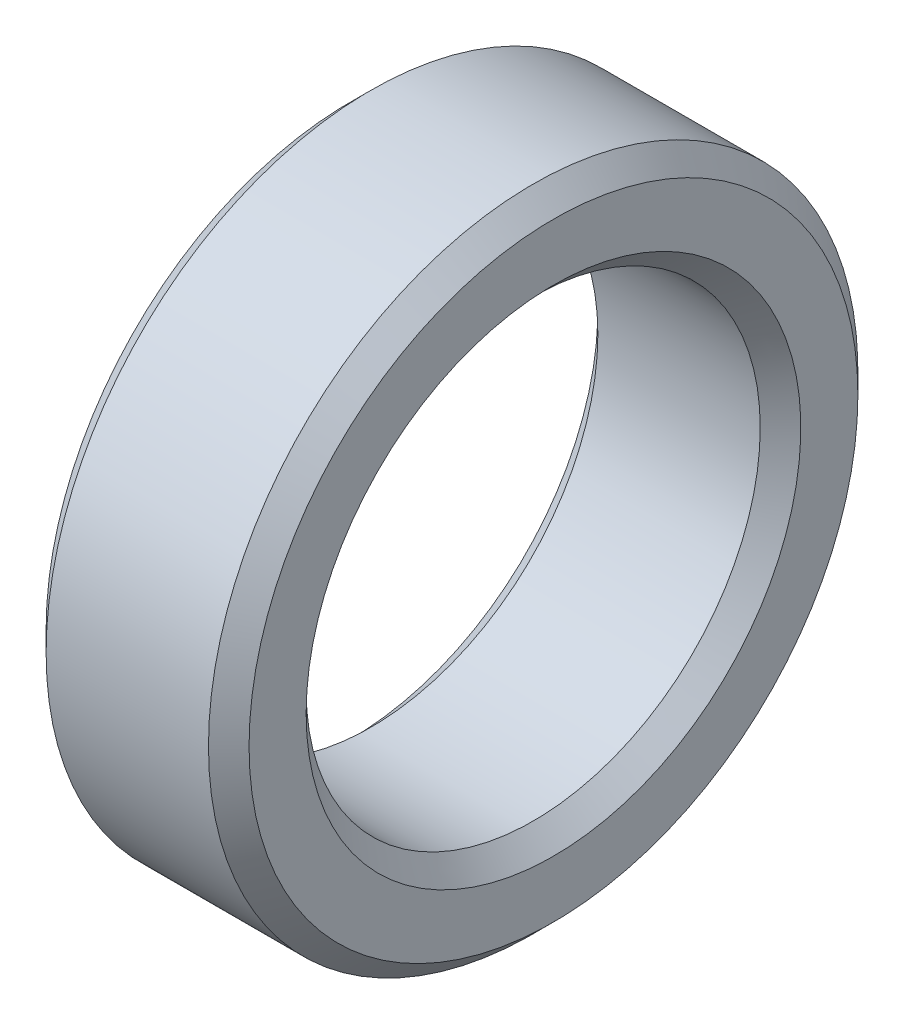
from build123d import *


with BuildPart() as part:
    # Sketch 1 → Revolve 1 (revolve)
    with BuildSketch(Plane.XY, mode=Mode.PRIVATE) as revolve_1_sk:
        Polygon((0, 12.188), (0, 15), (1, 16), (9, 16), (10, 15), (10, 12.188), (9, 11.188), (1, 11.188), align=None)
    revolve(revolve_1_sk.sketch.rotate(Axis((0, 0, 0), (1, 0, 0)), 90), axis=Axis((0, 0, 0), (1, 0, 0)))


solid = part.part
